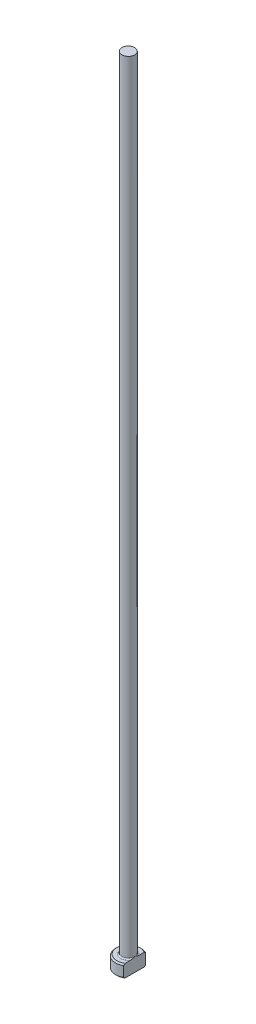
from build123d import *
from build123d.topology import SkipClean

# Parameters (mm, degrees)
CHAMFER1_SIZE = 0.2
FILLET1_R     = 0.2
KEY_DEPTH     = 126.031995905


with BuildPart() as part:
    # Sketch1 → Revolve1 (revolve)
    with BuildSketch(Plane.XY, mode=Mode.PRIVATE) as revolve1_sk:
        Polygon((0, 0), (-2, 0), (-2, 2), (-1, 2), (-1, 125), (0, 125), align=None)
    revolve(revolve1_sk.sketch.rotate(Axis((0, 259.958771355, 0), (0, -1, 0)), 270), axis=Axis((0, 259.958771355, 0), (0, -1, 0)))

    # Chamfer1
    chamfer1_edges = [part.edges().sort_by_distance(p)[0] for p in [
        (0, 2, -2),
        (0, 0, -2),
    ]]
    chamfer(chamfer1_edges, length=CHAMFER1_SIZE)

    # Fillet1
    fillet1_edges = [part.edges().sort_by_distance(p)[0] for p in [
        (0, 2, -1),
    ]]
    fillet(fillet1_edges, radius=FILLET1_R)

    # Sketch2 → KEY (cut, through all)
    with SkipClean():  # the faces are left unmerged after this step: merging them gives an invalid solid
        with BuildSketch(Plane(origin=(0, 0, 0), x_dir=(1, 0, 0), z_dir=(0, 1, 0))):
            with BuildLine():
                Line((1, 1.732050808), (1, -1.732050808))
                ThreePointArc((1, -1.732050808), (2, 0), (1, 1.732050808))
            make_face()
        extrude(amount=KEY_DEPTH, mode=Mode.SUBTRACT)


solid = part.part
